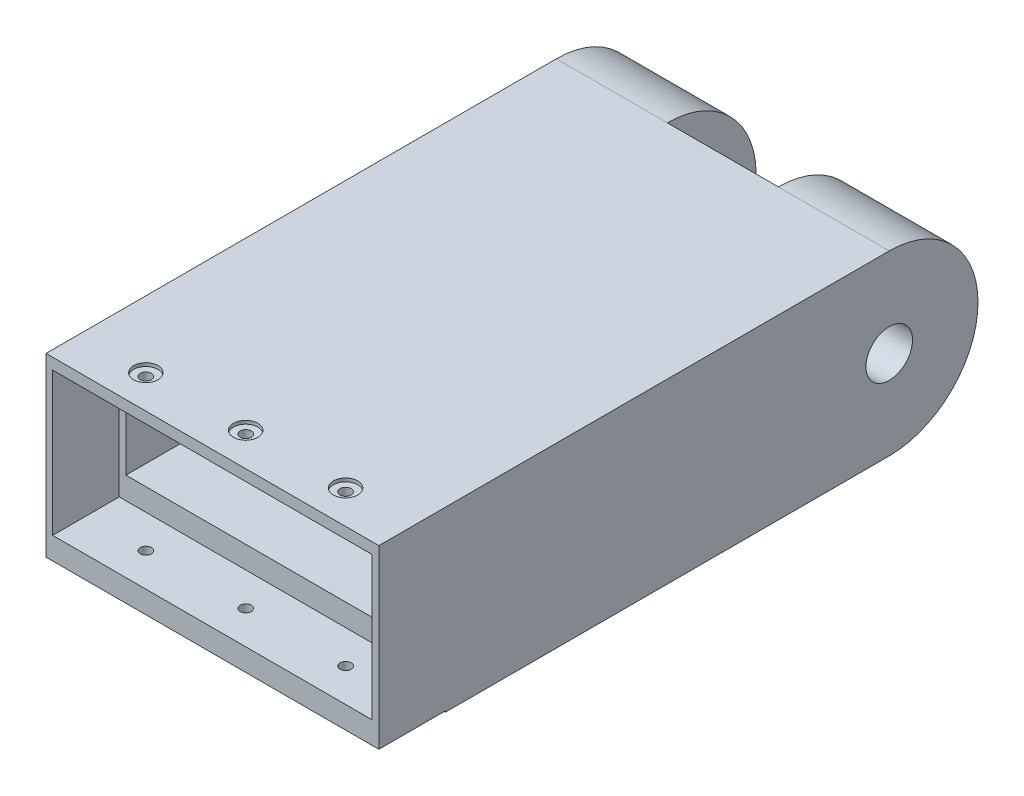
ISO-10303-21;
HEADER;
FILE_DESCRIPTION(('STEP AP214'),'2;1');
FILE_NAME('part.step','',(''),(''),'','','');
FILE_SCHEMA(('AUTOMOTIVE_DESIGN { 1 0 10303 214 1 1 1 1 }'));
ENDSEC;
DATA;
#1=APPLICATION_CONTEXT('core data for automotive mechanical design processes');
#2=APPLICATION_PROTOCOL_DEFINITION('international standard','automotive_design',2000,#1);
#3=PRODUCT_CONTEXT('',#1,'mechanical');
#4=PRODUCT('Part','Part','',(#3));
#5=PRODUCT_RELATED_PRODUCT_CATEGORY('part','',(#4));
#6=PRODUCT_DEFINITION_FORMATION('','',#4);
#7=PRODUCT_DEFINITION_CONTEXT('part definition',#1,'design');
#8=PRODUCT_DEFINITION('design','',#6,#7);
#9=PRODUCT_DEFINITION_SHAPE('','',#8);
#10=(LENGTH_UNIT() NAMED_UNIT(*) SI_UNIT(.MILLI.,.METRE.));
#11=(NAMED_UNIT(*) PLANE_ANGLE_UNIT() SI_UNIT($,.RADIAN.));
#12=(NAMED_UNIT(*) SI_UNIT($,.STERADIAN.) SOLID_ANGLE_UNIT());
#13=UNCERTAINTY_MEASURE_WITH_UNIT(LENGTH_MEASURE(1.E-05),#10,'distance_accuracy_value','');
#14=(GEOMETRIC_REPRESENTATION_CONTEXT(3) GLOBAL_UNCERTAINTY_ASSIGNED_CONTEXT((#13)) GLOBAL_UNIT_ASSIGNED_CONTEXT((#10,
#11,#12)) REPRESENTATION_CONTEXT('',''));
#15=CARTESIAN_POINT('',(0.,0.,0.));
#16=DIRECTION('',(0.,0.,1.));
#17=DIRECTION('',(1.,0.,0.));
#18=AXIS2_PLACEMENT_3D('',#15,#16,#17);
#19=CARTESIAN_POINT('',(-12.3023936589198,147.51739571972,1405.00000000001));
#20=DIRECTION('',(0.,-1.,0.));
#21=DIRECTION('',(0.,0.,-1.));
#22=AXIS2_PLACEMENT_3D('',#19,#20,#21);
#23=CYLINDRICAL_SURFACE('',#22,2.49999999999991);
#24=CARTESIAN_POINT('',(-12.3023936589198,137.51739571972,1405.00000000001));
#25=DIRECTION('',(0.,-1.,0.));
#26=DIRECTION('',(0.,0.,-1.));
#27=AXIS2_PLACEMENT_3D('',#24,#25,#26);
#28=CIRCLE('',#27,2.49999999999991);
#29=CARTESIAN_POINT('',(-12.3023936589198,137.51739571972,1402.50000000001));
#30=VERTEX_POINT('',#29);
#31=EDGE_CURVE('E385',#30,#30,#28,.T.);
#32=ORIENTED_EDGE('',*,*,#31,.T.);
#33=EDGE_LOOP('',(#32));
#34=FACE_BOUND('',#33,.T.);
#35=CARTESIAN_POINT('',(-12.3023936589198,141.01739571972,1405.00000000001));
#36=DIRECTION('',(0.,1.,0.));
#37=DIRECTION('',(0.,0.,1.));
#38=AXIS2_PLACEMENT_3D('',#35,#36,#37);
#39=CIRCLE('',#38,2.49999999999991);
#40=CARTESIAN_POINT('',(-12.3023936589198,141.01739571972,1407.50000000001));
#41=VERTEX_POINT('',#40);
#42=EDGE_CURVE('E45',#41,#41,#39,.F.);
#43=ORIENTED_EDGE('',*,*,#42,.F.);
#44=EDGE_LOOP('',(#43));
#45=FACE_BOUND('',#44,.T.);
#46=ADVANCED_FACE('F41',(#34,#45),#23,.F.);
#47=CARTESIAN_POINT('',(-57.3023936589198,147.51739571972,1405.00000000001));
#48=DIRECTION('',(0.,-1.,0.));
#49=DIRECTION('',(0.,0.,-1.));
#50=AXIS2_PLACEMENT_3D('',#47,#48,#49);
#51=CYLINDRICAL_SURFACE('',#50,2.49999999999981);
#52=CARTESIAN_POINT('',(-57.3023936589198,137.51739571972,1405.00000000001));
#53=DIRECTION('',(0.,-1.,0.));
#54=DIRECTION('',(0.,0.,-1.));
#55=AXIS2_PLACEMENT_3D('',#52,#53,#54);
#56=CIRCLE('',#55,2.49999999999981);
#57=CARTESIAN_POINT('',(-57.3023936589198,137.51739571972,1402.50000000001));
#58=VERTEX_POINT('',#57);
#59=EDGE_CURVE('E389',#58,#58,#56,.T.);
#60=ORIENTED_EDGE('',*,*,#59,.T.);
#61=EDGE_LOOP('',(#60));
#62=FACE_BOUND('',#61,.T.);
#63=CARTESIAN_POINT('',(-57.3023936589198,141.01739571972,1405.00000000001));
#64=DIRECTION('',(0.,1.,0.));
#65=DIRECTION('',(0.,0.,1.));
#66=AXIS2_PLACEMENT_3D('',#63,#64,#65);
#67=CIRCLE('',#66,2.49999999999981);
#68=CARTESIAN_POINT('',(-57.3023936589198,141.01739571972,1407.50000000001));
#69=VERTEX_POINT('',#68);
#70=EDGE_CURVE('E379',#69,#69,#67,.F.);
#71=ORIENTED_EDGE('',*,*,#70,.F.);
#72=EDGE_LOOP('',(#71));
#73=FACE_BOUND('',#72,.T.);
#74=ADVANCED_FACE('F512',(#62,#73),#51,.F.);
#75=CARTESIAN_POINT('',(-102.30239365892,147.51739571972,1405.00000000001));
#76=DIRECTION('',(0.,-1.,0.));
#77=DIRECTION('',(0.,0.,-1.));
#78=AXIS2_PLACEMENT_3D('',#75,#76,#77);
#79=CYLINDRICAL_SURFACE('',#78,2.49999999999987);
#80=CARTESIAN_POINT('',(-102.30239365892,137.51739571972,1405.00000000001));
#81=DIRECTION('',(0.,-1.,0.));
#82=DIRECTION('',(0.,0.,-1.));
#83=AXIS2_PLACEMENT_3D('',#80,#81,#82);
#84=CIRCLE('',#83,2.49999999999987);
#85=CARTESIAN_POINT('',(-102.30239365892,137.51739571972,1402.50000000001));
#86=VERTEX_POINT('',#85);
#87=EDGE_CURVE('E394',#86,#86,#84,.T.);
#88=ORIENTED_EDGE('',*,*,#87,.T.);
#89=EDGE_LOOP('',(#88));
#90=FACE_BOUND('',#89,.T.);
#91=CARTESIAN_POINT('',(-102.30239365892,141.01739571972,1405.00000000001));
#92=DIRECTION('',(0.,1.,0.));
#93=DIRECTION('',(0.,0.,1.));
#94=AXIS2_PLACEMENT_3D('',#91,#92,#93);
#95=CIRCLE('',#94,2.49999999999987);
#96=CARTESIAN_POINT('',(-102.30239365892,141.01739571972,1407.50000000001));
#97=VERTEX_POINT('',#96);
#98=EDGE_CURVE('E377',#97,#97,#95,.F.);
#99=ORIENTED_EDGE('',*,*,#98,.F.);
#100=EDGE_LOOP('',(#99));
#101=FACE_BOUND('',#100,.T.);
#102=ADVANCED_FACE('F518',(#90,#101),#79,.F.);
#103=CARTESIAN_POINT('',(17.6976063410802,62.5173957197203,1390.00000000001));
#104=DIRECTION('',(0.,0.,-1.));
#105=DIRECTION('',(-1.,0.,0.));
#106=AXIS2_PLACEMENT_3D('',#103,#104,#105);
#107=PLANE('',#106);
#108=DIRECTION('',(1.,0.,0.));
#109=VECTOR('',#108,1.);
#110=CARTESIAN_POINT('',(-132.30239365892,63.0246653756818,1390.00000000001));
#111=LINE('',#110,#109);
#112=CARTESIAN_POINT('',(-32.3023936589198,63.0246653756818,1390.00000000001));
#113=VERTEX_POINT('',#112);
#114=CARTESIAN_POINT('',(17.6976063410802,63.0246653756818,1390.00000000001));
#115=VERTEX_POINT('',#114);
#116=EDGE_CURVE('E12',#113,#115,#111,.T.);
#117=ORIENTED_EDGE('',*,*,#116,.F.);
#118=DIRECTION('',(0.,-1.,0.));
#119=VECTOR('',#118,1.);
#120=CARTESIAN_POINT('',(-32.3023936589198,62.5173957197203,1390.00000000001));
#121=LINE('',#120,#119);
#122=CARTESIAN_POINT('',(-32.3023936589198,62.5173957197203,1390.00000000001));
#123=VERTEX_POINT('',#122);
#124=EDGE_CURVE('E362',#113,#123,#121,.T.);
#125=ORIENTED_EDGE('',*,*,#124,.T.);
#126=DIRECTION('',(-1.,0.,0.));
#127=VECTOR('',#126,1.);
#128=CARTESIAN_POINT('',(17.6976063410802,62.5173957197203,1390.00000000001));
#129=LINE('',#128,#127);
#130=CARTESIAN_POINT('',(17.6976063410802,62.5173957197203,1390.00000000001));
#131=VERTEX_POINT('',#130);
#132=EDGE_CURVE('E367',#131,#123,#129,.T.);
#133=ORIENTED_EDGE('',*,*,#132,.F.);
#134=DIRECTION('',(0.,-1.,0.));
#135=VECTOR('',#134,1.);
#136=CARTESIAN_POINT('',(17.6976063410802,142.51739571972,1390.00000000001));
#137=LINE('',#136,#135);
#138=EDGE_CURVE('E356',#115,#131,#137,.T.);
#139=ORIENTED_EDGE('',*,*,#138,.F.);
#140=EDGE_LOOP('',(#117,#125,#133,#139));
#141=FACE_BOUND('',#140,.T.);
#142=ADVANCED_FACE('F479',(#141),#107,.F.);
#143=CARTESIAN_POINT('',(17.6976063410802,102.51739571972,1190.00000000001));
#144=DIRECTION('',(-1.,0.,0.));
#145=DIRECTION('',(0.,0.,1.));
#146=AXIS2_PLACEMENT_3D('',#143,#144,#145);
#147=CYLINDRICAL_SURFACE('',#146,40.);
#148=CARTESIAN_POINT('',(-32.3023936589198,102.51739571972,1190.00000000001));
#149=DIRECTION('',(1.,0.,0.));
#150=DIRECTION('',(0.,0.,1.));
#151=AXIS2_PLACEMENT_3D('',#148,#149,#150);
#152=CIRCLE('',#151,40.);
#153=CARTESIAN_POINT('',(-32.3023936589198,62.5173957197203,1190.00000000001));
#154=VERTEX_POINT('',#153);
#155=CARTESIAN_POINT('',(-32.3023936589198,142.51739571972,1190.00000000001));
#156=VERTEX_POINT('',#155);
#157=EDGE_CURVE('E349',#154,#156,#152,.T.);
#158=ORIENTED_EDGE('',*,*,#157,.T.);
#159=DIRECTION('',(-1.,0.,0.));
#160=VECTOR('',#159,1.);
#161=CARTESIAN_POINT('',(17.6976063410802,142.51739571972,1190.00000000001));
#162=LINE('',#161,#160);
#163=CARTESIAN_POINT('',(17.6976063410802,142.51739571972,1190.00000000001));
#164=VERTEX_POINT('',#163);
#165=EDGE_CURVE('E50',#164,#156,#162,.T.);
#166=ORIENTED_EDGE('',*,*,#165,.F.);
#167=CARTESIAN_POINT('',(17.6976063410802,102.51739571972,1190.00000000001));
#168=DIRECTION('',(1.,0.,0.));
#169=DIRECTION('',(0.,0.,1.));
#170=AXIS2_PLACEMENT_3D('',#167,#168,#169);
#171=CIRCLE('',#170,40.);
#172=CARTESIAN_POINT('',(17.6976063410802,62.5173957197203,1190.00000000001));
#173=VERTEX_POINT('',#172);
#174=EDGE_CURVE('E350',#173,#164,#171,.T.);
#175=ORIENTED_EDGE('',*,*,#174,.F.);
#176=DIRECTION('',(-1.,0.,0.));
#177=VECTOR('',#176,1.);
#178=CARTESIAN_POINT('',(17.6976063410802,62.5173957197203,1190.00000000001));
#179=LINE('',#178,#177);
#180=EDGE_CURVE('E360',#173,#154,#179,.T.);
#181=ORIENTED_EDGE('',*,*,#180,.T.);
#182=EDGE_LOOP('',(#158,#166,#175,#181));
#183=FACE_BOUND('',#182,.T.);
#184=ADVANCED_FACE('F43',(#183),#147,.T.);
#185=CARTESIAN_POINT('',(17.6976063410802,142.51739571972,1190.00000000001));
#186=DIRECTION('',(0.,-1.,0.));
#187=DIRECTION('',(0.,0.,-1.));
#188=AXIS2_PLACEMENT_3D('',#185,#186,#187);
#189=PLANE('',#188);
#190=CARTESIAN_POINT('',(-12.3023936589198,142.51739571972,1405.00000000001));
#191=DIRECTION('',(0.,1.,0.));
#192=DIRECTION('',(0.,0.,1.));
#193=AXIS2_PLACEMENT_3D('',#190,#191,#192);
#194=CIRCLE('',#193,5.49999999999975);
#195=CARTESIAN_POINT('',(-12.3023936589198,142.51739571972,1410.50000000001));
#196=VERTEX_POINT('',#195);
#197=EDGE_CURVE('E983',#196,#196,#194,.T.);
#198=ORIENTED_EDGE('',*,*,#197,.F.);
#199=EDGE_LOOP('',(#198));
#200=FACE_BOUND('',#199,.T.);
#201=CARTESIAN_POINT('',(-57.3023936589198,142.51739571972,1405.00000000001));
#202=DIRECTION('',(0.,1.,0.));
#203=DIRECTION('',(0.,0.,1.));
#204=AXIS2_PLACEMENT_3D('',#201,#202,#203);
#205=CIRCLE('',#204,5.49999999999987);
#206=CARTESIAN_POINT('',(-57.3023936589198,142.51739571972,1410.50000000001));
#207=VERTEX_POINT('',#206);
#208=EDGE_CURVE('E984',#207,#207,#205,.T.);
#209=ORIENTED_EDGE('',*,*,#208,.F.);
#210=EDGE_LOOP('',(#209));
#211=FACE_BOUND('',#210,.T.);
#212=CARTESIAN_POINT('',(-102.30239365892,142.51739571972,1405.00000000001));
#213=DIRECTION('',(0.,1.,0.));
#214=DIRECTION('',(0.,0.,1.));
#215=AXIS2_PLACEMENT_3D('',#212,#213,#214);
#216=CIRCLE('',#215,5.4999999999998);
#217=CARTESIAN_POINT('',(-102.30239365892,142.51739571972,1410.50000000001));
#218=VERTEX_POINT('',#217);
#219=EDGE_CURVE('E993',#218,#218,#216,.T.);
#220=ORIENTED_EDGE('',*,*,#219,.F.);
#221=EDGE_LOOP('',(#220));
#222=FACE_BOUND('',#221,.T.);
#223=ORIENTED_EDGE('',*,*,#165,.T.);
#224=DIRECTION('',(1.,0.,0.));
#225=VECTOR('',#224,1.);
#226=CARTESIAN_POINT('',(-82.3023936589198,142.51739571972,1190.00000000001));
#227=LINE('',#226,#225);
#228=CARTESIAN_POINT('',(-82.3023936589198,142.51739571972,1190.00000000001));
#229=VERTEX_POINT('',#228);
#230=EDGE_CURVE('E346',#229,#156,#227,.T.);
#231=ORIENTED_EDGE('',*,*,#230,.F.);
#232=DIRECTION('',(1.,0.,0.));
#233=VECTOR('',#232,1.);
#234=CARTESIAN_POINT('',(-132.30239365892,142.51739571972,1190.00000000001));
#235=LINE('',#234,#233);
#236=CARTESIAN_POINT('',(-132.30239365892,142.51739571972,1190.00000000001));
#237=VERTEX_POINT('',#236);
#238=EDGE_CURVE('E319',#237,#229,#235,.T.);
#239=ORIENTED_EDGE('',*,*,#238,.F.);
#240=DIRECTION('',(0.,0.,-1.));
#241=VECTOR('',#240,1.);
#242=CARTESIAN_POINT('',(-132.30239365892,142.51739571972,1190.00000000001));
#243=LINE('',#242,#241);
#244=CARTESIAN_POINT('',(-132.30239365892,142.51739571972,1420.00000000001));
#245=VERTEX_POINT('',#244);
#246=EDGE_CURVE('E317',#245,#237,#243,.T.);
#247=ORIENTED_EDGE('',*,*,#246,.F.);
#248=DIRECTION('',(-1.,0.,0.));
#249=VECTOR('',#248,1.);
#250=CARTESIAN_POINT('',(-132.30239365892,142.51739571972,1420.00000000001));
#251=LINE('',#250,#249);
#252=CARTESIAN_POINT('',(17.6976063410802,142.51739571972,1420.00000000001));
#253=VERTEX_POINT('',#252);
#254=EDGE_CURVE('E242',#253,#245,#251,.T.);
#255=ORIENTED_EDGE('',*,*,#254,.F.);
#256=DIRECTION('',(0.,0.,1.));
#257=VECTOR('',#256,1.);
#258=CARTESIAN_POINT('',(17.6976063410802,142.51739571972,1190.00000000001));
#259=LINE('',#258,#257);
#260=EDGE_CURVE('E353',#164,#253,#259,.T.);
#261=ORIENTED_EDGE('',*,*,#260,.F.);
#262=EDGE_LOOP('',(#223,#231,#239,#247,#255,#261));
#263=FACE_BOUND('',#262,.T.);
#264=ADVANCED_FACE('F494',(#200,#211,#222,#263),#189,.F.);
#265=DIRECTION('',(-1.,0.,0.));
#266=VECTOR('',#265,1.);
#267=CARTESIAN_POINT('',(-129.30239365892,137.51739571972,1390.00000000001));
#268=LINE('',#267,#266);
#269=CARTESIAN_POINT('',(14.6976063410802,137.51739571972,1390.00000000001));
#270=VERTEX_POINT('',#269);
#271=CARTESIAN_POINT('',(-129.30239365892,137.51739571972,1390.00000000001));
#272=VERTEX_POINT('',#271);
#273=EDGE_CURVE('E202',#270,#272,#268,.T.);
#274=ORIENTED_EDGE('',*,*,#273,.T.);
#275=DIRECTION('',(0.,-1.,0.));
#276=VECTOR('',#275,1.);
#277=CARTESIAN_POINT('',(-129.30239365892,137.51739571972,1390.00000000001));
#278=LINE('',#277,#276);
#279=CARTESIAN_POINT('',(-129.30239365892,73.0246653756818,1390.00000000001));
#280=VERTEX_POINT('',#279);
#281=EDGE_CURVE('E222',#272,#280,#278,.T.);
#282=ORIENTED_EDGE('',*,*,#281,.T.);
#283=DIRECTION('',(1.,0.,0.));
#284=VECTOR('',#283,1.);
#285=CARTESIAN_POINT('',(-129.30239365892,73.0246653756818,1390.00000000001));
#286=LINE('',#285,#284);
#287=CARTESIAN_POINT('',(14.6976063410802,73.0246653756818,1390.00000000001));
#288=VERTEX_POINT('',#287);
#289=EDGE_CURVE('E208',#280,#288,#286,.T.);
#290=ORIENTED_EDGE('',*,*,#289,.T.);
#291=DIRECTION('',(0.,1.,0.));
#292=VECTOR('',#291,1.);
#293=CARTESIAN_POINT('',(14.6976063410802,137.51739571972,1390.00000000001));
#294=LINE('',#293,#292);
#295=EDGE_CURVE('E226',#288,#270,#294,.T.);
#296=ORIENTED_EDGE('',*,*,#295,.T.);
#297=EDGE_LOOP('',(#274,#282,#290,#296));
#298=FACE_BOUND('',#297,.T.);
#299=DIRECTION('',(0.,-1.,0.));
#300=VECTOR('',#299,1.);
#301=CARTESIAN_POINT('',(-126.30239365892,83.0246653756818,1390.00000000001));
#302=LINE('',#301,#300);
#303=CARTESIAN_POINT('',(-126.30239365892,132.51739571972,1390.00000000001));
#304=VERTEX_POINT('',#303);
#305=CARTESIAN_POINT('',(-126.30239365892,83.0246653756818,1390.00000000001));
#306=VERTEX_POINT('',#305);
#307=EDGE_CURVE('E297',#304,#306,#302,.T.);
#308=ORIENTED_EDGE('',*,*,#307,.F.);
#309=DIRECTION('',(1.,0.,0.));
#310=VECTOR('',#309,1.);
#311=CARTESIAN_POINT('',(-323.80834750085,132.51739571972,1390.00000000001));
#312=LINE('',#311,#310);
#313=CARTESIAN_POINT('',(11.6976063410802,132.51739571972,1390.00000000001));
#314=VERTEX_POINT('',#313);
#315=EDGE_CURVE('E281',#304,#314,#312,.T.);
#316=ORIENTED_EDGE('',*,*,#315,.T.);
#317=DIRECTION('',(0.,-1.,0.));
#318=VECTOR('',#317,1.);
#319=CARTESIAN_POINT('',(11.6976063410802,83.0246653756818,1390.00000000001));
#320=LINE('',#319,#318);
#321=CARTESIAN_POINT('',(11.6976063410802,83.0246653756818,1390.00000000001));
#322=VERTEX_POINT('',#321);
#323=EDGE_CURVE('E271',#314,#322,#320,.T.);
#324=ORIENTED_EDGE('',*,*,#323,.T.);
#325=DIRECTION('',(1.,0.,0.));
#326=VECTOR('',#325,1.);
#327=CARTESIAN_POINT('',(-323.80834750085,83.0246653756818,1390.00000000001));
#328=LINE('',#327,#326);
#329=EDGE_CURVE('E296',#306,#322,#328,.T.);
#330=ORIENTED_EDGE('',*,*,#329,.F.);
#331=EDGE_LOOP('',(#308,#316,#324,#330));
#332=FACE_BOUND('',#331,.T.);
#333=ADVANCED_FACE('F612',(#298,#332),#107,.F.);
#334=CARTESIAN_POINT('',(17.6976063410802,62.5173957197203,1190.00000000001));
#335=DIRECTION('',(0.,1.,0.));
#336=DIRECTION('',(-1.,0.,0.));
#337=AXIS2_PLACEMENT_3D('',#334,#335,#336);
#338=PLANE('',#337);
#339=DIRECTION('',(0.,0.,-1.));
#340=VECTOR('',#339,1.);
#341=CARTESIAN_POINT('',(-32.3023936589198,62.5173957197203,1190.00000000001));
#342=LINE('',#341,#340);
#343=EDGE_CURVE('E354',#123,#154,#342,.T.);
#344=ORIENTED_EDGE('',*,*,#343,.T.);
#345=ORIENTED_EDGE('',*,*,#180,.F.);
#346=DIRECTION('',(0.,0.,-1.));
#347=VECTOR('',#346,1.);
#348=CARTESIAN_POINT('',(17.6976063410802,62.5173957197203,1190.00000000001));
#349=LINE('',#348,#347);
#350=EDGE_CURVE('E358',#131,#173,#349,.T.);
#351=ORIENTED_EDGE('',*,*,#350,.F.);
#352=ORIENTED_EDGE('',*,*,#132,.T.);
#353=EDGE_LOOP('',(#344,#345,#351,#352));
#354=FACE_BOUND('',#353,.T.);
#355=ADVANCED_FACE('F482',(#354),#338,.F.);
#356=CARTESIAN_POINT('',(17.6976063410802,102.51739571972,1190.00000000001));
#357=DIRECTION('',(-1.,0.,0.));
#358=DIRECTION('',(0.,0.,1.));
#359=AXIS2_PLACEMENT_3D('',#356,#357,#358);
#360=PLANE('',#359);
#361=CARTESIAN_POINT('',(17.6976063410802,102.51739571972,1190.00000000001));
#362=DIRECTION('',(-1.,0.,0.));
#363=DIRECTION('',(0.,0.,1.));
#364=AXIS2_PLACEMENT_3D('',#361,#362,#363);
#365=CIRCLE('',#364,10.4999999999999);
#366=CARTESIAN_POINT('',(17.6976063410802,102.51739571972,1200.50000000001));
#367=VERTEX_POINT('',#366);
#368=EDGE_CURVE('E376',#367,#367,#365,.T.);
#369=ORIENTED_EDGE('',*,*,#368,.T.);
#370=EDGE_LOOP('',(#369));
#371=FACE_BOUND('',#370,.T.);
#372=ORIENTED_EDGE('',*,*,#174,.T.);
#373=ORIENTED_EDGE('',*,*,#260,.T.);
#374=DIRECTION('',(0.,1.,0.));
#375=VECTOR('',#374,1.);
#376=CARTESIAN_POINT('',(17.6976063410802,142.51739571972,1420.00000000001));
#377=LINE('',#376,#375);
#378=CARTESIAN_POINT('',(17.6976063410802,63.0246653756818,1420.00000000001));
#379=VERTEX_POINT('',#378);
#380=EDGE_CURVE('E239',#379,#253,#377,.T.);
#381=ORIENTED_EDGE('',*,*,#380,.F.);
#382=DIRECTION('',(0.,0.,-1.));
#383=VECTOR('',#382,1.);
#384=CARTESIAN_POINT('',(17.6976063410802,63.0246653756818,1420.00000000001));
#385=LINE('',#384,#383);
#386=EDGE_CURVE('E244',#379,#115,#385,.T.);
#387=ORIENTED_EDGE('',*,*,#386,.T.);
#388=ORIENTED_EDGE('',*,*,#138,.T.);
#389=ORIENTED_EDGE('',*,*,#350,.T.);
#390=EDGE_LOOP('',(#372,#373,#381,#387,#388,#389));
#391=FACE_BOUND('',#390,.T.);
#392=ADVANCED_FACE('F486',(#371,#391),#360,.F.);
#393=CARTESIAN_POINT('',(-32.3023936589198,102.51739571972,1190.00000000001));
#394=DIRECTION('',(-1.,0.,0.));
#395=DIRECTION('',(0.,0.,1.));
#396=AXIS2_PLACEMENT_3D('',#393,#394,#395);
#397=PLANE('',#396);
#398=CARTESIAN_POINT('',(-32.3023936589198,102.51739571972,1190.00000000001));
#399=DIRECTION('',(-1.,0.,0.));
#400=DIRECTION('',(0.,0.,1.));
#401=AXIS2_PLACEMENT_3D('',#398,#399,#400);
#402=CIRCLE('',#401,10.4999999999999);
#403=CARTESIAN_POINT('',(-32.3023936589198,102.51739571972,1200.50000000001));
#404=VERTEX_POINT('',#403);
#405=EDGE_CURVE('E402',#404,#404,#402,.T.);
#406=ORIENTED_EDGE('',*,*,#405,.F.);
#407=EDGE_LOOP('',(#406));
#408=FACE_BOUND('',#407,.T.);
#409=DIRECTION('',(0.,0.,1.));
#410=VECTOR('',#409,1.);
#411=CARTESIAN_POINT('',(-32.3023936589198,63.0246653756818,1183.64986220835));
#412=LINE('',#411,#410);
#413=CARTESIAN_POINT('',(-32.3023936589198,63.0246653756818,1223.64986220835));
#414=VERTEX_POINT('',#413);
#415=EDGE_CURVE('E338',#414,#113,#412,.T.);
#416=ORIENTED_EDGE('',*,*,#415,.F.);
#417=DIRECTION('',(0.,-1.,0.));
#418=VECTOR('',#417,1.);
#419=CARTESIAN_POINT('',(-32.3023936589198,142.51839571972,1223.64986220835));
#420=LINE('',#419,#418);
#421=CARTESIAN_POINT('',(-32.3023936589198,83.0246653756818,1223.64986220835));
#422=VERTEX_POINT('',#421);
#423=EDGE_CURVE('E257',#422,#414,#420,.T.);
#424=ORIENTED_EDGE('',*,*,#423,.F.);
#425=DIRECTION('',(0.,0.,-1.));
#426=VECTOR('',#425,1.);
#427=CARTESIAN_POINT('',(-32.3023936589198,83.0246653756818,1183.64986220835));
#428=LINE('',#427,#426);
#429=CARTESIAN_POINT('',(-32.3023936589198,83.0246653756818,1205.6535447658));
#430=VERTEX_POINT('',#429);
#431=EDGE_CURVE('E260',#422,#430,#428,.T.);
#432=ORIENTED_EDGE('',*,*,#431,.T.);
#433=CARTESIAN_POINT('',(-32.3023936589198,102.51739571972,1190.00000000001));
#434=DIRECTION('',(-1.,0.,0.));
#435=DIRECTION('',(0.,0.,1.));
#436=AXIS2_PLACEMENT_3D('',#433,#434,#435);
#437=CIRCLE('',#436,25.);
#438=CARTESIAN_POINT('',(-32.3023936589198,122.51739571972,1205.00000000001));
#439=VERTEX_POINT('',#438);
#440=EDGE_CURVE('E308',#439,#430,#437,.F.);
#441=ORIENTED_EDGE('',*,*,#440,.F.);
#442=CARTESIAN_POINT('',(-32.3023936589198,102.51739571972,1190.00000000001));
#443=DIRECTION('',(1.,0.,0.));
#444=DIRECTION('',(0.,0.,-1.));
#445=AXIS2_PLACEMENT_3D('',#442,#443,#444);
#446=CIRCLE('',#445,25.);
#447=CARTESIAN_POINT('',(-32.3023936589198,127.51739571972,1190.00000000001));
#448=VERTEX_POINT('',#447);
#449=EDGE_CURVE('E327',#448,#439,#446,.T.);
#450=ORIENTED_EDGE('',*,*,#449,.F.);
#451=DIRECTION('',(0.,-1.,0.));
#452=VECTOR('',#451,1.);
#453=CARTESIAN_POINT('',(-32.3023936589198,142.51739571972,1190.00000000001));
#454=LINE('',#453,#452);
#455=EDGE_CURVE('E341',#156,#448,#454,.T.);
#456=ORIENTED_EDGE('',*,*,#455,.F.);
#457=ORIENTED_EDGE('',*,*,#157,.F.);
#458=ORIENTED_EDGE('',*,*,#343,.F.);
#459=ORIENTED_EDGE('',*,*,#124,.F.);
#460=EDGE_LOOP('',(#416,#424,#432,#441,#450,#456,#457,#458,#459));
#461=FACE_BOUND('',#460,.T.);
#462=ADVANCED_FACE('F473',(#408,#461),#397,.T.);
#463=CARTESIAN_POINT('',(-82.3023936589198,102.51739571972,1190.00000000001));
#464=DIRECTION('',(1.,0.,0.));
#465=DIRECTION('',(0.,0.,-1.));
#466=AXIS2_PLACEMENT_3D('',#463,#464,#465);
#467=CYLINDRICAL_SURFACE('',#466,25.);
#468=ORIENTED_EDGE('',*,*,#449,.T.);
#469=DIRECTION('',(1.,0.,0.));
#470=VECTOR('',#469,1.);
#471=CARTESIAN_POINT('',(-323.80834750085,122.51739571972,1205.00000000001));
#472=LINE('',#471,#470);
#473=CARTESIAN_POINT('',(-82.3023936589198,122.51739571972,1205.00000000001));
#474=VERTEX_POINT('',#473);
#475=EDGE_CURVE('E301',#474,#439,#472,.T.);
#476=ORIENTED_EDGE('',*,*,#475,.F.);
#477=CARTESIAN_POINT('',(-82.3023936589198,102.51739571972,1190.00000000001));
#478=DIRECTION('',(1.,0.,0.));
#479=DIRECTION('',(0.,0.,-1.));
#480=AXIS2_PLACEMENT_3D('',#477,#478,#479);
#481=CIRCLE('',#480,25.);
#482=CARTESIAN_POINT('',(-82.3023936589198,127.51739571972,1190.00000000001));
#483=VERTEX_POINT('',#482);
#484=EDGE_CURVE('E328',#483,#474,#481,.T.);
#485=ORIENTED_EDGE('',*,*,#484,.F.);
#486=DIRECTION('',(1.,0.,0.));
#487=VECTOR('',#486,1.);
#488=CARTESIAN_POINT('',(-82.3023936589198,127.51739571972,1190.00000000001));
#489=LINE('',#488,#487);
#490=EDGE_CURVE('E335',#483,#448,#489,.T.);
#491=ORIENTED_EDGE('',*,*,#490,.T.);
#492=EDGE_LOOP('',(#468,#476,#485,#491));
#493=FACE_BOUND('',#492,.T.);
#494=ADVANCED_FACE('F453',(#493),#467,.F.);
#495=CARTESIAN_POINT('',(-82.3023936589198,63.0246653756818,1183.64986220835));
#496=DIRECTION('',(0.,1.,0.));
#497=DIRECTION('',(-1.,0.,0.));
#498=AXIS2_PLACEMENT_3D('',#495,#496,#497);
#499=PLANE('',#498);
#500=CARTESIAN_POINT('',(-102.30239365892,63.0246653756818,1405.00000000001));
#501=DIRECTION('',(0.,-1.,0.));
#502=DIRECTION('',(1.,0.,0.));
#503=AXIS2_PLACEMENT_3D('',#500,#501,#502);
#504=CIRCLE('',#503,5.49999999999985);
#505=CARTESIAN_POINT('',(-96.80239365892,63.0246653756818,1405.00000000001));
#506=VERTEX_POINT('',#505);
#507=EDGE_CURVE('E426',#506,#506,#504,.T.);
#508=ORIENTED_EDGE('',*,*,#507,.F.);
#509=EDGE_LOOP('',(#508));
#510=FACE_BOUND('',#509,.T.);
#511=CARTESIAN_POINT('',(-57.3023936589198,63.0246653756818,1405.00000000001));
#512=DIRECTION('',(0.,-1.,0.));
#513=DIRECTION('',(1.,0.,0.));
#514=AXIS2_PLACEMENT_3D('',#511,#512,#513);
#515=CIRCLE('',#514,5.49999999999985);
#516=CARTESIAN_POINT('',(-51.8023936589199,63.0246653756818,1405.00000000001));
#517=VERTEX_POINT('',#516);
#518=EDGE_CURVE('E429',#517,#517,#515,.T.);
#519=ORIENTED_EDGE('',*,*,#518,.F.);
#520=EDGE_LOOP('',(#519));
#521=FACE_BOUND('',#520,.T.);
#522=CARTESIAN_POINT('',(-12.3023936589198,63.0246653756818,1405.00000000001));
#523=DIRECTION('',(0.,-1.,0.));
#524=DIRECTION('',(1.,0.,0.));
#525=AXIS2_PLACEMENT_3D('',#522,#523,#524);
#526=CIRCLE('',#525,5.49999999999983);
#527=CARTESIAN_POINT('',(-6.80239365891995,63.0246653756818,1405.00000000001));
#528=VERTEX_POINT('',#527);
#529=EDGE_CURVE('E435',#528,#528,#526,.T.);
#530=ORIENTED_EDGE('',*,*,#529,.F.);
#531=EDGE_LOOP('',(#530));
#532=FACE_BOUND('',#531,.T.);
#533=DIRECTION('',(1.,0.,0.));
#534=VECTOR('',#533,1.);
#535=CARTESIAN_POINT('',(-132.30239365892,63.0246653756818,1183.64986220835));
#536=LINE('',#535,#534);
#537=CARTESIAN_POINT('',(-132.30239365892,63.0246653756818,1183.64986220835));
#538=VERTEX_POINT('',#537);
#539=CARTESIAN_POINT('',(-82.3023936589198,63.0246653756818,1183.64986220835));
#540=VERTEX_POINT('',#539);
#541=EDGE_CURVE('E324',#538,#540,#536,.T.);
#542=ORIENTED_EDGE('',*,*,#541,.T.);
#543=DIRECTION('',(0.,0.,-1.));
#544=VECTOR('',#543,1.);
#545=CARTESIAN_POINT('',(-82.3023936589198,63.0246653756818,1183.64986220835));
#546=LINE('',#545,#544);
#547=CARTESIAN_POINT('',(-82.3023936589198,63.0246653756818,1223.64986220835));
#548=VERTEX_POINT('',#547);
#549=EDGE_CURVE('E252',#548,#540,#546,.T.);
#550=ORIENTED_EDGE('',*,*,#549,.F.);
#551=DIRECTION('',(-1.,0.,0.));
#552=VECTOR('',#551,1.);
#553=CARTESIAN_POINT('',(-82.3023936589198,63.0246653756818,1223.64986220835));
#554=LINE('',#553,#552);
#555=EDGE_CURVE('E254',#414,#548,#554,.T.);
#556=ORIENTED_EDGE('',*,*,#555,.F.);
#557=ORIENTED_EDGE('',*,*,#415,.T.);
#558=ORIENTED_EDGE('',*,*,#116,.T.);
#559=ORIENTED_EDGE('',*,*,#386,.F.);
#560=DIRECTION('',(1.,0.,0.));
#561=VECTOR('',#560,1.);
#562=CARTESIAN_POINT('',(-132.30239365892,63.0246653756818,1420.00000000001));
#563=LINE('',#562,#561);
#564=CARTESIAN_POINT('',(-132.30239365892,63.0246653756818,1420.00000000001));
#565=VERTEX_POINT('',#564);
#566=EDGE_CURVE('E237',#565,#379,#563,.T.);
#567=ORIENTED_EDGE('',*,*,#566,.F.);
#568=DIRECTION('',(0.,0.,1.));
#569=VECTOR('',#568,1.);
#570=CARTESIAN_POINT('',(-132.30239365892,63.0246653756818,1390.00000000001));
#571=LINE('',#570,#569);
#572=EDGE_CURVE('E315',#538,#565,#571,.T.);
#573=ORIENTED_EDGE('',*,*,#572,.F.);
#574=EDGE_LOOP('',(#542,#550,#556,#557,#558,#559,#567,#573));
#575=FACE_BOUND('',#574,.T.);
#576=ADVANCED_FACE('F449',(#510,#521,#532,#575),#499,.F.);
#577=CARTESIAN_POINT('',(-82.3023936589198,142.51739571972,1190.00000000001));
#578=DIRECTION('',(0.,0.,1.));
#579=DIRECTION('',(1.,0.,0.));
#580=AXIS2_PLACEMENT_3D('',#577,#578,#579);
#581=PLANE('',#580);
#582=ORIENTED_EDGE('',*,*,#455,.T.);
#583=ORIENTED_EDGE('',*,*,#490,.F.);
#584=DIRECTION('',(0.,-1.,0.));
#585=VECTOR('',#584,1.);
#586=CARTESIAN_POINT('',(-82.3023936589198,142.51739571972,1190.00000000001));
#587=LINE('',#586,#585);
#588=EDGE_CURVE('E331',#229,#483,#587,.T.);
#589=ORIENTED_EDGE('',*,*,#588,.F.);
#590=ORIENTED_EDGE('',*,*,#230,.T.);
#591=EDGE_LOOP('',(#582,#583,#589,#590));
#592=FACE_BOUND('',#591,.T.);
#593=ADVANCED_FACE('F452',(#592),#581,.F.);
#594=CARTESIAN_POINT('',(-132.30239365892,102.51739571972,1190.00000000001));
#595=DIRECTION('',(1.,0.,0.));
#596=DIRECTION('',(0.,0.,-1.));
#597=AXIS2_PLACEMENT_3D('',#594,#595,#596);
#598=CYLINDRICAL_SURFACE('',#597,40.);
#599=CARTESIAN_POINT('',(-82.3023936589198,102.51739571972,1190.00000000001));
#600=DIRECTION('',(-1.,0.,0.));
#601=DIRECTION('',(0.,0.,1.));
#602=AXIS2_PLACEMENT_3D('',#599,#600,#601);
#603=CIRCLE('',#602,40.);
#604=EDGE_CURVE('E311',#229,#540,#603,.T.);
#605=ORIENTED_EDGE('',*,*,#604,.T.);
#606=ORIENTED_EDGE('',*,*,#541,.F.);
#607=CARTESIAN_POINT('',(-132.30239365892,102.51739571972,1190.00000000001));
#608=DIRECTION('',(-1.,0.,0.));
#609=DIRECTION('',(0.,0.,1.));
#610=AXIS2_PLACEMENT_3D('',#607,#608,#609);
#611=CIRCLE('',#610,40.);
#612=EDGE_CURVE('E312',#237,#538,#611,.T.);
#613=ORIENTED_EDGE('',*,*,#612,.F.);
#614=ORIENTED_EDGE('',*,*,#238,.T.);
#615=EDGE_LOOP('',(#605,#606,#613,#614));
#616=FACE_BOUND('',#615,.T.);
#617=ADVANCED_FACE('F463',(#616),#598,.T.);
#618=CARTESIAN_POINT('',(-132.30239365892,102.51739571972,1190.00000000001));
#619=DIRECTION('',(-1.,0.,0.));
#620=DIRECTION('',(0.,0.,1.));
#621=AXIS2_PLACEMENT_3D('',#618,#619,#620);
#622=PLANE('',#621);
#623=CARTESIAN_POINT('',(-132.30239365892,102.51739571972,1190.00000000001));
#624=DIRECTION('',(-1.,0.,0.));
#625=DIRECTION('',(0.,0.,1.));
#626=AXIS2_PLACEMENT_3D('',#623,#624,#625);
#627=CIRCLE('',#626,10.4999999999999);
#628=CARTESIAN_POINT('',(-132.30239365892,102.51739571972,1200.50000000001));
#629=VERTEX_POINT('',#628);
#630=EDGE_CURVE('E375',#629,#629,#627,.T.);
#631=ORIENTED_EDGE('',*,*,#630,.F.);
#632=EDGE_LOOP('',(#631));
#633=FACE_BOUND('',#632,.T.);
#634=ORIENTED_EDGE('',*,*,#612,.T.);
#635=ORIENTED_EDGE('',*,*,#572,.T.);
#636=DIRECTION('',(0.,-1.,0.));
#637=VECTOR('',#636,1.);
#638=CARTESIAN_POINT('',(-132.30239365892,142.51739571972,1420.00000000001));
#639=LINE('',#638,#637);
#640=EDGE_CURVE('E209',#245,#565,#639,.T.);
#641=ORIENTED_EDGE('',*,*,#640,.F.);
#642=ORIENTED_EDGE('',*,*,#246,.T.);
#643=EDGE_LOOP('',(#634,#635,#641,#642));
#644=FACE_BOUND('',#643,.T.);
#645=ADVANCED_FACE('F496',(#633,#644),#622,.T.);
#646=CARTESIAN_POINT('',(-82.3023936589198,102.51739571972,1190.00000000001));
#647=DIRECTION('',(-1.,0.,0.));
#648=DIRECTION('',(0.,0.,1.));
#649=AXIS2_PLACEMENT_3D('',#646,#647,#648);
#650=PLANE('',#649);
#651=CARTESIAN_POINT('',(-82.3023936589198,102.51739571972,1190.00000000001));
#652=DIRECTION('',(-1.,0.,0.));
#653=DIRECTION('',(0.,0.,1.));
#654=AXIS2_PLACEMENT_3D('',#651,#652,#653);
#655=CIRCLE('',#654,10.4999999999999);
#656=CARTESIAN_POINT('',(-82.3023936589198,102.51739571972,1200.50000000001));
#657=VERTEX_POINT('',#656);
#658=EDGE_CURVE('E372',#657,#657,#655,.T.);
#659=ORIENTED_EDGE('',*,*,#658,.T.);
#660=EDGE_LOOP('',(#659));
#661=FACE_BOUND('',#660,.T.);
#662=ORIENTED_EDGE('',*,*,#549,.T.);
#663=ORIENTED_EDGE('',*,*,#604,.F.);
#664=ORIENTED_EDGE('',*,*,#588,.T.);
#665=ORIENTED_EDGE('',*,*,#484,.T.);
#666=CARTESIAN_POINT('',(-82.3023936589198,83.0246653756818,1205.6535447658));
#667=VERTEX_POINT('',#666);
#668=EDGE_CURVE('E332',#474,#667,#481,.T.);
#669=ORIENTED_EDGE('',*,*,#668,.T.);
#670=DIRECTION('',(0.,0.,1.));
#671=VECTOR('',#670,1.);
#672=CARTESIAN_POINT('',(-82.3023936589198,83.0246653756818,1183.64986220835));
#673=LINE('',#672,#671);
#674=CARTESIAN_POINT('',(-82.3023936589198,83.0246653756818,1223.64986220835));
#675=VERTEX_POINT('',#674);
#676=EDGE_CURVE('E249',#667,#675,#673,.T.);
#677=ORIENTED_EDGE('',*,*,#676,.T.);
#678=DIRECTION('',(0.,-1.,0.));
#679=VECTOR('',#678,1.);
#680=CARTESIAN_POINT('',(-82.3023936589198,142.51839571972,1223.64986220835));
#681=LINE('',#680,#679);
#682=EDGE_CURVE('E258',#675,#548,#681,.T.);
#683=ORIENTED_EDGE('',*,*,#682,.T.);
#684=EDGE_LOOP('',(#662,#663,#664,#665,#669,#677,#683));
#685=FACE_BOUND('',#684,.T.);
#686=ADVANCED_FACE('F466',(#661,#685),#650,.F.);
#687=CARTESIAN_POINT('',(-323.80834750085,102.51739571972,1190.00000000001));
#688=DIRECTION('',(1.,0.,0.));
#689=DIRECTION('',(0.,0.,-1.));
#690=AXIS2_PLACEMENT_3D('',#687,#688,#689);
#691=CYLINDRICAL_SURFACE('',#690,25.);
#692=CARTESIAN_POINT('',(-126.30239365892,122.51739571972,1205.00000000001));
#693=VERTEX_POINT('',#692);
#694=EDGE_CURVE('E286',#693,#474,#472,.T.);
#695=ORIENTED_EDGE('',*,*,#694,.F.);
#696=CARTESIAN_POINT('',(-126.30239365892,102.51739571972,1190.00000000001));
#697=DIRECTION('',(-1.,0.,0.));
#698=DIRECTION('',(0.,0.,1.));
#699=AXIS2_PLACEMENT_3D('',#696,#697,#698);
#700=CIRCLE('',#699,25.);
#701=CARTESIAN_POINT('',(-126.30239365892,83.0246653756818,1205.6535447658));
#702=VERTEX_POINT('',#701);
#703=EDGE_CURVE('E287',#702,#693,#700,.T.);
#704=ORIENTED_EDGE('',*,*,#703,.F.);
#705=DIRECTION('',(1.,0.,0.));
#706=VECTOR('',#705,1.);
#707=CARTESIAN_POINT('',(-323.80834750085,83.0246653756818,1205.6535447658));
#708=LINE('',#707,#706);
#709=EDGE_CURVE('E291',#702,#667,#708,.T.);
#710=ORIENTED_EDGE('',*,*,#709,.T.);
#711=ORIENTED_EDGE('',*,*,#668,.F.);
#712=EDGE_LOOP('',(#695,#704,#710,#711));
#713=FACE_BOUND('',#712,.T.);
#714=ADVANCED_FACE('F504',(#713),#691,.T.);
#715=CARTESIAN_POINT('',(-126.30239365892,102.51739571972,1190.00000000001));
#716=DIRECTION('',(-1.,0.,0.));
#717=DIRECTION('',(0.,0.,1.));
#718=AXIS2_PLACEMENT_3D('',#715,#716,#717);
#719=PLANE('',#718);
#720=DIRECTION('',(0.,1.,0.));
#721=VECTOR('',#720,1.);
#722=CARTESIAN_POINT('',(-126.30239365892,122.51739571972,1205.00000000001));
#723=LINE('',#722,#721);
#724=CARTESIAN_POINT('',(-126.30239365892,132.51739571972,1205.00000000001));
#725=VERTEX_POINT('',#724);
#726=EDGE_CURVE('E282',#693,#725,#723,.T.);
#727=ORIENTED_EDGE('',*,*,#726,.T.);
#728=DIRECTION('',(0.,0.,1.));
#729=VECTOR('',#728,1.);
#730=CARTESIAN_POINT('',(-126.30239365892,132.51739571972,1205.00000000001));
#731=LINE('',#730,#729);
#732=EDGE_CURVE('E267',#725,#304,#731,.T.);
#733=ORIENTED_EDGE('',*,*,#732,.T.);
#734=ORIENTED_EDGE('',*,*,#307,.T.);
#735=DIRECTION('',(0.,0.,-1.));
#736=VECTOR('',#735,1.);
#737=CARTESIAN_POINT('',(-126.30239365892,83.0246653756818,1205.6535447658));
#738=LINE('',#737,#736);
#739=EDGE_CURVE('E292',#306,#702,#738,.T.);
#740=ORIENTED_EDGE('',*,*,#739,.T.);
#741=ORIENTED_EDGE('',*,*,#703,.T.);
#742=EDGE_LOOP('',(#727,#733,#734,#740,#741));
#743=FACE_BOUND('',#742,.T.);
#744=ADVANCED_FACE('F581',(#743),#719,.F.);
#745=CARTESIAN_POINT('',(11.6976063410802,102.51739571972,1190.00000000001));
#746=DIRECTION('',(1.,0.,0.));
#747=DIRECTION('',(0.,0.,-1.));
#748=AXIS2_PLACEMENT_3D('',#745,#746,#747);
#749=PLANE('',#748);
#750=DIRECTION('',(0.,1.,0.));
#751=VECTOR('',#750,1.);
#752=CARTESIAN_POINT('',(11.6976063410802,122.51739571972,1205.00000000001));
#753=LINE('',#752,#751);
#754=CARTESIAN_POINT('',(11.6976063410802,122.51739571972,1205.00000000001));
#755=VERTEX_POINT('',#754);
#756=CARTESIAN_POINT('',(11.6976063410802,132.51739571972,1205.00000000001));
#757=VERTEX_POINT('',#756);
#758=EDGE_CURVE('E263',#755,#757,#753,.T.);
#759=ORIENTED_EDGE('',*,*,#758,.F.);
#760=CARTESIAN_POINT('',(11.6976063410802,102.51739571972,1190.00000000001));
#761=DIRECTION('',(-1.,0.,0.));
#762=DIRECTION('',(0.,0.,-1.));
#763=AXIS2_PLACEMENT_3D('',#760,#761,#762);
#764=CIRCLE('',#763,25.);
#765=CARTESIAN_POINT('',(11.6976063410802,83.0246653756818,1205.6535447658));
#766=VERTEX_POINT('',#765);
#767=EDGE_CURVE('E264',#766,#755,#764,.T.);
#768=ORIENTED_EDGE('',*,*,#767,.F.);
#769=DIRECTION('',(0.,0.,-1.));
#770=VECTOR('',#769,1.);
#771=CARTESIAN_POINT('',(11.6976063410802,83.0246653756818,1205.6535447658));
#772=LINE('',#771,#770);
#773=EDGE_CURVE('E268',#322,#766,#772,.T.);
#774=ORIENTED_EDGE('',*,*,#773,.F.);
#775=ORIENTED_EDGE('',*,*,#323,.F.);
#776=DIRECTION('',(0.,0.,1.));
#777=VECTOR('',#776,1.);
#778=CARTESIAN_POINT('',(11.6976063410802,132.51739571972,1205.00000000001));
#779=LINE('',#778,#777);
#780=EDGE_CURVE('E274',#757,#314,#779,.T.);
#781=ORIENTED_EDGE('',*,*,#780,.F.);
#782=EDGE_LOOP('',(#759,#768,#774,#775,#781));
#783=FACE_BOUND('',#782,.T.);
#784=ADVANCED_FACE('F577',(#783),#749,.F.);
#785=CARTESIAN_POINT('',(-323.80834750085,132.51739571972,1205.00000000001));
#786=DIRECTION('',(0.,1.,0.));
#787=DIRECTION('',(-1.,0.,0.));
#788=AXIS2_PLACEMENT_3D('',#785,#786,#787);
#789=PLANE('',#788);
#790=DIRECTION('',(1.,0.,0.));
#791=VECTOR('',#790,1.);
#792=CARTESIAN_POINT('',(-323.80834750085,132.51739571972,1205.00000000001));
#793=LINE('',#792,#791);
#794=EDGE_CURVE('E285',#725,#757,#793,.T.);
#795=ORIENTED_EDGE('',*,*,#794,.T.);
#796=ORIENTED_EDGE('',*,*,#780,.T.);
#797=ORIENTED_EDGE('',*,*,#315,.F.);
#798=ORIENTED_EDGE('',*,*,#732,.F.);
#799=EDGE_LOOP('',(#795,#796,#797,#798));
#800=FACE_BOUND('',#799,.T.);
#801=ADVANCED_FACE('F580',(#800),#789,.F.);
#802=CARTESIAN_POINT('',(-323.80834750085,83.0246653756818,1205.6535447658));
#803=DIRECTION('',(0.,-1.,0.));
#804=DIRECTION('',(0.,0.,-1.));
#805=AXIS2_PLACEMENT_3D('',#802,#803,#804);
#806=PLANE('',#805);
#807=DIRECTION('',(1.,0.,0.));
#808=VECTOR('',#807,1.);
#809=CARTESIAN_POINT('',(-82.3023936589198,83.0246653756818,1223.64986220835));
#810=LINE('',#809,#808);
#811=EDGE_CURVE('E66',#675,#422,#810,.T.);
#812=ORIENTED_EDGE('',*,*,#811,.F.);
#813=ORIENTED_EDGE('',*,*,#676,.F.);
#814=ORIENTED_EDGE('',*,*,#709,.F.);
#815=ORIENTED_EDGE('',*,*,#739,.F.);
#816=ORIENTED_EDGE('',*,*,#329,.T.);
#817=ORIENTED_EDGE('',*,*,#773,.T.);
#818=EDGE_CURVE('E295',#430,#766,#708,.T.);
#819=ORIENTED_EDGE('',*,*,#818,.F.);
#820=ORIENTED_EDGE('',*,*,#431,.F.);
#821=EDGE_LOOP('',(#812,#813,#814,#815,#816,#817,#819,#820));
#822=FACE_BOUND('',#821,.T.);
#823=ADVANCED_FACE('F589',(#822),#806,.F.);
#824=ORIENTED_EDGE('',*,*,#440,.T.);
#825=ORIENTED_EDGE('',*,*,#818,.T.);
#826=ORIENTED_EDGE('',*,*,#767,.T.);
#827=EDGE_CURVE('E290',#439,#755,#472,.T.);
#828=ORIENTED_EDGE('',*,*,#827,.F.);
#829=EDGE_LOOP('',(#824,#825,#826,#828));
#830=FACE_BOUND('',#829,.T.);
#831=ADVANCED_FACE('F585',(#830),#691,.T.);
#832=CARTESIAN_POINT('',(-323.80834750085,122.51739571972,1205.00000000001));
#833=DIRECTION('',(0.,0.,-1.));
#834=DIRECTION('',(-1.,0.,0.));
#835=AXIS2_PLACEMENT_3D('',#832,#833,#834);
#836=PLANE('',#835);
#837=ORIENTED_EDGE('',*,*,#694,.T.);
#838=ORIENTED_EDGE('',*,*,#475,.T.);
#839=ORIENTED_EDGE('',*,*,#827,.T.);
#840=ORIENTED_EDGE('',*,*,#758,.T.);
#841=ORIENTED_EDGE('',*,*,#794,.F.);
#842=ORIENTED_EDGE('',*,*,#726,.F.);
#843=EDGE_LOOP('',(#837,#838,#839,#840,#841,#842));
#844=FACE_BOUND('',#843,.T.);
#845=ADVANCED_FACE('F576',(#844),#836,.F.);
#846=CARTESIAN_POINT('',(-82.3023936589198,142.51839571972,1223.64986220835));
#847=DIRECTION('',(0.,0.,1.));
#848=DIRECTION('',(0.,-1.,0.));
#849=AXIS2_PLACEMENT_3D('',#846,#847,#848);
#850=PLANE('',#849);
#851=ORIENTED_EDGE('',*,*,#811,.T.);
#852=ORIENTED_EDGE('',*,*,#423,.T.);
#853=ORIENTED_EDGE('',*,*,#555,.T.);
#854=ORIENTED_EDGE('',*,*,#682,.F.);
#855=EDGE_LOOP('',(#851,#852,#853,#854));
#856=FACE_BOUND('',#855,.T.);
#857=ADVANCED_FACE('F469',(#856),#850,.F.);
#858=CARTESIAN_POINT('',(0.,0.,1420.00000000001));
#859=DIRECTION('',(0.,0.,1.));
#860=DIRECTION('',(1.,0.,0.));
#861=AXIS2_PLACEMENT_3D('',#858,#859,#860);
#862=PLANE('',#861);
#863=ORIENTED_EDGE('',*,*,#640,.T.);
#864=ORIENTED_EDGE('',*,*,#566,.T.);
#865=ORIENTED_EDGE('',*,*,#380,.T.);
#866=ORIENTED_EDGE('',*,*,#254,.T.);
#867=EDGE_LOOP('',(#863,#864,#865,#866));
#868=FACE_BOUND('',#867,.T.);
#869=DIRECTION('',(1.,0.,0.));
#870=VECTOR('',#869,1.);
#871=CARTESIAN_POINT('',(-129.30239365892,73.0246653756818,1420.00000000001));
#872=LINE('',#871,#870);
#873=CARTESIAN_POINT('',(-129.30239365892,73.0246653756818,1420.00000000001));
#874=VERTEX_POINT('',#873);
#875=CARTESIAN_POINT('',(14.6976063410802,73.0246653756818,1420.00000000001));
#876=VERTEX_POINT('',#875);
#877=EDGE_CURVE('E201',#874,#876,#872,.T.);
#878=ORIENTED_EDGE('',*,*,#877,.F.);
#879=DIRECTION('',(0.,-1.,0.));
#880=VECTOR('',#879,1.);
#881=CARTESIAN_POINT('',(-129.30239365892,137.51739571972,1420.00000000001));
#882=LINE('',#881,#880);
#883=CARTESIAN_POINT('',(-129.30239365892,137.51739571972,1420.00000000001));
#884=VERTEX_POINT('',#883);
#885=EDGE_CURVE('E193',#884,#874,#882,.T.);
#886=ORIENTED_EDGE('',*,*,#885,.F.);
#887=DIRECTION('',(-1.,0.,0.));
#888=VECTOR('',#887,1.);
#889=CARTESIAN_POINT('',(-129.30239365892,137.51739571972,1420.00000000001));
#890=LINE('',#889,#888);
#891=CARTESIAN_POINT('',(14.6976063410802,137.51739571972,1420.00000000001));
#892=VERTEX_POINT('',#891);
#893=EDGE_CURVE('E217',#892,#884,#890,.T.);
#894=ORIENTED_EDGE('',*,*,#893,.F.);
#895=DIRECTION('',(0.,1.,0.));
#896=VECTOR('',#895,1.);
#897=CARTESIAN_POINT('',(14.6976063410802,137.51739571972,1420.00000000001));
#898=LINE('',#897,#896);
#899=EDGE_CURVE('E215',#876,#892,#898,.T.);
#900=ORIENTED_EDGE('',*,*,#899,.F.);
#901=EDGE_LOOP('',(#878,#886,#894,#900));
#902=FACE_BOUND('',#901,.T.);
#903=ADVANCED_FACE('F213',(#868,#902),#862,.T.);
#904=CARTESIAN_POINT('',(-129.30239365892,137.51739571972,1420.00000000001));
#905=DIRECTION('',(1.,0.,0.));
#906=DIRECTION('',(0.,0.,-1.));
#907=AXIS2_PLACEMENT_3D('',#904,#905,#906);
#908=PLANE('',#907);
#909=ORIENTED_EDGE('',*,*,#281,.F.);
#910=DIRECTION('',(0.,0.,-1.));
#911=VECTOR('',#910,1.);
#912=CARTESIAN_POINT('',(-129.30239365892,137.51739571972,1420.00000000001));
#913=LINE('',#912,#911);
#914=EDGE_CURVE('E58',#884,#272,#913,.T.);
#915=ORIENTED_EDGE('',*,*,#914,.F.);
#916=ORIENTED_EDGE('',*,*,#885,.T.);
#917=DIRECTION('',(0.,0.,-1.));
#918=VECTOR('',#917,1.);
#919=CARTESIAN_POINT('',(-129.30239365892,73.0246653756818,1420.00000000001));
#920=LINE('',#919,#918);
#921=EDGE_CURVE('E196',#874,#280,#920,.T.);
#922=ORIENTED_EDGE('',*,*,#921,.T.);
#923=EDGE_LOOP('',(#909,#915,#916,#922));
#924=FACE_BOUND('',#923,.T.);
#925=ADVANCED_FACE('F195',(#924),#908,.T.);
#926=CARTESIAN_POINT('',(-129.30239365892,73.0246653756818,1420.00000000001));
#927=DIRECTION('',(0.,1.,0.));
#928=DIRECTION('',(0.,0.,1.));
#929=AXIS2_PLACEMENT_3D('',#926,#927,#928);
#930=PLANE('',#929);
#931=CARTESIAN_POINT('',(-102.30239365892,73.0246653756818,1405.00000000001));
#932=DIRECTION('',(0.,1.,0.));
#933=DIRECTION('',(0.,0.,1.));
#934=AXIS2_PLACEMENT_3D('',#931,#932,#933);
#935=CIRCLE('',#934,2.49999999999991);
#936=CARTESIAN_POINT('',(-102.30239365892,73.0246653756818,1407.50000000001));
#937=VERTEX_POINT('',#936);
#938=EDGE_CURVE('E406',#937,#937,#935,.F.);
#939=ORIENTED_EDGE('',*,*,#938,.T.);
#940=EDGE_LOOP('',(#939));
#941=FACE_BOUND('',#940,.T.);
#942=CARTESIAN_POINT('',(-57.3023936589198,73.0246653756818,1405.00000000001));
#943=DIRECTION('',(0.,1.,0.));
#944=DIRECTION('',(0.,0.,1.));
#945=AXIS2_PLACEMENT_3D('',#942,#943,#944);
#946=CIRCLE('',#945,2.49999999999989);
#947=CARTESIAN_POINT('',(-57.3023936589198,73.0246653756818,1407.50000000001));
#948=VERTEX_POINT('',#947);
#949=EDGE_CURVE('E410',#948,#948,#946,.F.);
#950=ORIENTED_EDGE('',*,*,#949,.T.);
#951=EDGE_LOOP('',(#950));
#952=FACE_BOUND('',#951,.T.);
#953=CARTESIAN_POINT('',(-12.3023936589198,73.0246653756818,1405.00000000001));
#954=DIRECTION('',(0.,1.,0.));
#955=DIRECTION('',(0.,0.,1.));
#956=AXIS2_PLACEMENT_3D('',#953,#954,#955);
#957=CIRCLE('',#956,2.49999999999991);
#958=CARTESIAN_POINT('',(-12.3023936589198,73.0246653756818,1407.50000000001));
#959=VERTEX_POINT('',#958);
#960=EDGE_CURVE('E417',#959,#959,#957,.F.);
#961=ORIENTED_EDGE('',*,*,#960,.T.);
#962=EDGE_LOOP('',(#961));
#963=FACE_BOUND('',#962,.T.);
#964=ORIENTED_EDGE('',*,*,#289,.F.);
#965=ORIENTED_EDGE('',*,*,#921,.F.);
#966=ORIENTED_EDGE('',*,*,#877,.T.);
#967=DIRECTION('',(0.,0.,-1.));
#968=VECTOR('',#967,1.);
#969=CARTESIAN_POINT('',(14.6976063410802,73.0246653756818,1420.00000000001));
#970=LINE('',#969,#968);
#971=EDGE_CURVE('E210',#876,#288,#970,.T.);
#972=ORIENTED_EDGE('',*,*,#971,.T.);
#973=EDGE_LOOP('',(#964,#965,#966,#972));
#974=FACE_BOUND('',#973,.T.);
#975=ADVANCED_FACE('F205',(#941,#952,#963,#974),#930,.T.);
#976=CARTESIAN_POINT('',(14.6976063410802,137.51739571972,1420.00000000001));
#977=DIRECTION('',(-1.,0.,0.));
#978=DIRECTION('',(0.,0.,1.));
#979=AXIS2_PLACEMENT_3D('',#976,#977,#978);
#980=PLANE('',#979);
#981=ORIENTED_EDGE('',*,*,#295,.F.);
#982=ORIENTED_EDGE('',*,*,#971,.F.);
#983=ORIENTED_EDGE('',*,*,#899,.T.);
#984=DIRECTION('',(0.,0.,-1.));
#985=VECTOR('',#984,1.);
#986=CARTESIAN_POINT('',(14.6976063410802,137.51739571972,1420.00000000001));
#987=LINE('',#986,#985);
#988=EDGE_CURVE('E232',#892,#270,#987,.T.);
#989=ORIENTED_EDGE('',*,*,#988,.T.);
#990=EDGE_LOOP('',(#981,#982,#983,#989));
#991=FACE_BOUND('',#990,.T.);
#992=ADVANCED_FACE('F562',(#991),#980,.T.);
#993=CARTESIAN_POINT('',(-129.30239365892,137.51739571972,1420.00000000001));
#994=DIRECTION('',(0.,-1.,0.));
#995=DIRECTION('',(0.,0.,-1.));
#996=AXIS2_PLACEMENT_3D('',#993,#994,#995);
#997=PLANE('',#996);
#998=ORIENTED_EDGE('',*,*,#87,.F.);
#999=EDGE_LOOP('',(#998));
#1000=FACE_BOUND('',#999,.T.);
#1001=ORIENTED_EDGE('',*,*,#59,.F.);
#1002=EDGE_LOOP('',(#1001));
#1003=FACE_BOUND('',#1002,.T.);
#1004=ORIENTED_EDGE('',*,*,#31,.F.);
#1005=EDGE_LOOP('',(#1004));
#1006=FACE_BOUND('',#1005,.T.);
#1007=ORIENTED_EDGE('',*,*,#273,.F.);
#1008=ORIENTED_EDGE('',*,*,#988,.F.);
#1009=ORIENTED_EDGE('',*,*,#893,.T.);
#1010=ORIENTED_EDGE('',*,*,#914,.T.);
#1011=EDGE_LOOP('',(#1007,#1008,#1009,#1010));
#1012=FACE_BOUND('',#1011,.T.);
#1013=ADVANCED_FACE('F445',(#1000,#1003,#1006,#1012),#997,.T.);
#1014=CARTESIAN_POINT('',(-12.3023936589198,65.5246653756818,1405.00000000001));
#1015=DIRECTION('',(0.,-1.,0.));
#1016=DIRECTION('',(1.,0.,0.));
#1017=AXIS2_PLACEMENT_3D('',#1014,#1015,#1016);
#1018=CYLINDRICAL_SURFACE('',#1017,5.49999999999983);
#1019=CARTESIAN_POINT('',(-12.3023936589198,65.5246653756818,1405.00000000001));
#1020=DIRECTION('',(0.,-1.,0.));
#1021=DIRECTION('',(1.,0.,0.));
#1022=AXIS2_PLACEMENT_3D('',#1019,#1020,#1021);
#1023=CIRCLE('',#1022,5.49999999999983);
#1024=CARTESIAN_POINT('',(-6.80239365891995,65.5246653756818,1405.00000000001));
#1025=VERTEX_POINT('',#1024);
#1026=EDGE_CURVE('E413',#1025,#1025,#1023,.T.);
#1027=ORIENTED_EDGE('',*,*,#1026,.F.);
#1028=EDGE_LOOP('',(#1027));
#1029=FACE_BOUND('',#1028,.T.);
#1030=ORIENTED_EDGE('',*,*,#529,.T.);
#1031=EDGE_LOOP('',(#1030));
#1032=FACE_BOUND('',#1031,.T.);
#1033=ADVANCED_FACE('F442',(#1029,#1032),#1018,.F.);
#1034=CARTESIAN_POINT('',(-12.3023936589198,65.5246653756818,1405.00000000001));
#1035=DIRECTION('',(0.,-1.,0.));
#1036=DIRECTION('',(1.,0.,0.));
#1037=AXIS2_PLACEMENT_3D('',#1034,#1035,#1036);
#1038=PLANE('',#1037);
#1039=CARTESIAN_POINT('',(-12.3023936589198,65.5246653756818,1405.00000000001));
#1040=DIRECTION('',(0.,-1.,0.));
#1041=DIRECTION('',(1.,0.,0.));
#1042=AXIS2_PLACEMENT_3D('',#1039,#1040,#1041);
#1043=CIRCLE('',#1042,2.49999999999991);
#1044=CARTESIAN_POINT('',(-9.80239365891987,65.5246653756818,1405.00000000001));
#1045=VERTEX_POINT('',#1044);
#1046=EDGE_CURVE('E405',#1045,#1045,#1043,.T.);
#1047=ORIENTED_EDGE('',*,*,#1046,.F.);
#1048=EDGE_LOOP('',(#1047));
#1049=FACE_BOUND('',#1048,.T.);
#1050=ORIENTED_EDGE('',*,*,#1026,.T.);
#1051=EDGE_LOOP('',(#1050));
#1052=FACE_BOUND('',#1051,.T.);
#1053=ADVANCED_FACE('F440',(#1049,#1052),#1038,.T.);
#1054=CARTESIAN_POINT('',(-57.3023936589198,65.5246653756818,1405.00000000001));
#1055=DIRECTION('',(0.,-1.,0.));
#1056=DIRECTION('',(1.,0.,0.));
#1057=AXIS2_PLACEMENT_3D('',#1054,#1055,#1056);
#1058=CYLINDRICAL_SURFACE('',#1057,5.49999999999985);
#1059=CARTESIAN_POINT('',(-57.3023936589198,65.5246653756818,1405.00000000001));
#1060=DIRECTION('',(0.,-1.,0.));
#1061=DIRECTION('',(1.,0.,0.));
#1062=AXIS2_PLACEMENT_3D('',#1059,#1060,#1061);
#1063=CIRCLE('',#1062,5.49999999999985);
#1064=CARTESIAN_POINT('',(-51.8023936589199,65.5246653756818,1405.00000000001));
#1065=VERTEX_POINT('',#1064);
#1066=EDGE_CURVE('E432',#1065,#1065,#1063,.T.);
#1067=ORIENTED_EDGE('',*,*,#1066,.F.);
#1068=EDGE_LOOP('',(#1067));
#1069=FACE_BOUND('',#1068,.T.);
#1070=ORIENTED_EDGE('',*,*,#518,.T.);
#1071=EDGE_LOOP('',(#1070));
#1072=FACE_BOUND('',#1071,.T.);
#1073=ADVANCED_FACE('F551',(#1069,#1072),#1058,.F.);
#1074=CARTESIAN_POINT('',(-57.3023936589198,65.5246653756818,1405.00000000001));
#1075=DIRECTION('',(0.,-1.,0.));
#1076=DIRECTION('',(1.,0.,0.));
#1077=AXIS2_PLACEMENT_3D('',#1074,#1075,#1076);
#1078=PLANE('',#1077);
#1079=CARTESIAN_POINT('',(-57.3023936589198,65.5246653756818,1405.00000000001));
#1080=DIRECTION('',(0.,-1.,0.));
#1081=DIRECTION('',(1.,0.,0.));
#1082=AXIS2_PLACEMENT_3D('',#1079,#1080,#1081);
#1083=CIRCLE('',#1082,2.49999999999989);
#1084=CARTESIAN_POINT('',(-54.8023936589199,65.5246653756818,1405.00000000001));
#1085=VERTEX_POINT('',#1084);
#1086=EDGE_CURVE('E414',#1085,#1085,#1083,.T.);
#1087=ORIENTED_EDGE('',*,*,#1086,.F.);
#1088=EDGE_LOOP('',(#1087));
#1089=FACE_BOUND('',#1088,.T.);
#1090=ORIENTED_EDGE('',*,*,#1066,.T.);
#1091=EDGE_LOOP('',(#1090));
#1092=FACE_BOUND('',#1091,.T.);
#1093=ADVANCED_FACE('F549',(#1089,#1092),#1078,.T.);
#1094=CARTESIAN_POINT('',(-102.30239365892,65.5246653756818,1405.00000000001));
#1095=DIRECTION('',(0.,-1.,0.));
#1096=DIRECTION('',(1.,0.,0.));
#1097=AXIS2_PLACEMENT_3D('',#1094,#1095,#1096);
#1098=CYLINDRICAL_SURFACE('',#1097,5.49999999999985);
#1099=CARTESIAN_POINT('',(-102.30239365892,65.5246653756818,1405.00000000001));
#1100=DIRECTION('',(0.,-1.,0.));
#1101=DIRECTION('',(1.,0.,0.));
#1102=AXIS2_PLACEMENT_3D('',#1099,#1100,#1101);
#1103=CIRCLE('',#1102,5.49999999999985);
#1104=CARTESIAN_POINT('',(-96.80239365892,65.5246653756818,1405.00000000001));
#1105=VERTEX_POINT('',#1104);
#1106=EDGE_CURVE('E224',#1105,#1105,#1103,.T.);
#1107=ORIENTED_EDGE('',*,*,#1106,.F.);
#1108=EDGE_LOOP('',(#1107));
#1109=FACE_BOUND('',#1108,.T.);
#1110=ORIENTED_EDGE('',*,*,#507,.T.);
#1111=EDGE_LOOP('',(#1110));
#1112=FACE_BOUND('',#1111,.T.);
#1113=ADVANCED_FACE('F545',(#1109,#1112),#1098,.F.);
#1114=CARTESIAN_POINT('',(-102.30239365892,65.5246653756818,1405.00000000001));
#1115=DIRECTION('',(0.,-1.,0.));
#1116=DIRECTION('',(1.,0.,0.));
#1117=AXIS2_PLACEMENT_3D('',#1114,#1115,#1116);
#1118=PLANE('',#1117);
#1119=CARTESIAN_POINT('',(-102.30239365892,65.5246653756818,1405.00000000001));
#1120=DIRECTION('',(0.,-1.,0.));
#1121=DIRECTION('',(1.,0.,0.));
#1122=AXIS2_PLACEMENT_3D('',#1119,#1120,#1121);
#1123=CIRCLE('',#1122,2.49999999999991);
#1124=CARTESIAN_POINT('',(-99.8023936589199,65.5246653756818,1405.00000000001));
#1125=VERTEX_POINT('',#1124);
#1126=EDGE_CURVE('E409',#1125,#1125,#1123,.T.);
#1127=ORIENTED_EDGE('',*,*,#1126,.F.);
#1128=EDGE_LOOP('',(#1127));
#1129=FACE_BOUND('',#1128,.T.);
#1130=ORIENTED_EDGE('',*,*,#1106,.T.);
#1131=EDGE_LOOP('',(#1130));
#1132=FACE_BOUND('',#1131,.T.);
#1133=ADVANCED_FACE('F541',(#1129,#1132),#1118,.T.);
#1134=CARTESIAN_POINT('',(-12.3023936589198,142.51839571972,1405.00000000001));
#1135=DIRECTION('',(0.,-1.,0.));
#1136=DIRECTION('',(1.,0.,0.));
#1137=AXIS2_PLACEMENT_3D('',#1134,#1135,#1136);
#1138=CYLINDRICAL_SURFACE('',#1137,2.49999999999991);
#1139=ORIENTED_EDGE('',*,*,#960,.F.);
#1140=EDGE_LOOP('',(#1139));
#1141=FACE_BOUND('',#1140,.T.);
#1142=ORIENTED_EDGE('',*,*,#1046,.T.);
#1143=EDGE_LOOP('',(#1142));
#1144=FACE_BOUND('',#1143,.T.);
#1145=ADVANCED_FACE('F537',(#1141,#1144),#1138,.F.);
#1146=CARTESIAN_POINT('',(-57.3023936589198,142.51839571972,1405.00000000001));
#1147=DIRECTION('',(0.,-1.,0.));
#1148=DIRECTION('',(1.,0.,0.));
#1149=AXIS2_PLACEMENT_3D('',#1146,#1147,#1148);
#1150=CYLINDRICAL_SURFACE('',#1149,2.49999999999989);
#1151=ORIENTED_EDGE('',*,*,#949,.F.);
#1152=EDGE_LOOP('',(#1151));
#1153=FACE_BOUND('',#1152,.T.);
#1154=ORIENTED_EDGE('',*,*,#1086,.T.);
#1155=EDGE_LOOP('',(#1154));
#1156=FACE_BOUND('',#1155,.T.);
#1157=ADVANCED_FACE('F533',(#1153,#1156),#1150,.F.);
#1158=CARTESIAN_POINT('',(-102.30239365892,142.51839571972,1405.00000000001));
#1159=DIRECTION('',(0.,-1.,0.));
#1160=DIRECTION('',(1.,0.,0.));
#1161=AXIS2_PLACEMENT_3D('',#1158,#1159,#1160);
#1162=CYLINDRICAL_SURFACE('',#1161,2.49999999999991);
#1163=ORIENTED_EDGE('',*,*,#938,.F.);
#1164=EDGE_LOOP('',(#1163));
#1165=FACE_BOUND('',#1164,.T.);
#1166=ORIENTED_EDGE('',*,*,#1126,.T.);
#1167=EDGE_LOOP('',(#1166));
#1168=FACE_BOUND('',#1167,.T.);
#1169=ADVANCED_FACE('F530',(#1165,#1168),#1162,.F.);
#1170=CARTESIAN_POINT('',(17.6976063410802,102.51739571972,1190.00000000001));
#1171=DIRECTION('',(-1.,0.,0.));
#1172=DIRECTION('',(0.,0.,1.));
#1173=AXIS2_PLACEMENT_3D('',#1170,#1171,#1172);
#1174=CYLINDRICAL_SURFACE('',#1173,10.4999999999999);
#1175=ORIENTED_EDGE('',*,*,#630,.T.);
#1176=EDGE_LOOP('',(#1175));
#1177=FACE_BOUND('',#1176,.T.);
#1178=ORIENTED_EDGE('',*,*,#658,.F.);
#1179=EDGE_LOOP('',(#1178));
#1180=FACE_BOUND('',#1179,.T.);
#1181=ADVANCED_FACE('F528',(#1177,#1180),#1174,.F.);
#1182=ORIENTED_EDGE('',*,*,#405,.T.);
#1183=EDGE_LOOP('',(#1182));
#1184=FACE_BOUND('',#1183,.T.);
#1185=ORIENTED_EDGE('',*,*,#368,.F.);
#1186=EDGE_LOOP('',(#1185));
#1187=FACE_BOUND('',#1186,.T.);
#1188=ADVANCED_FACE('F524',(#1184,#1187),#1174,.F.);
#1189=CARTESIAN_POINT('',(-102.30239365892,141.01739571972,1405.00000000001));
#1190=DIRECTION('',(0.,1.,0.));
#1191=DIRECTION('',(0.,0.,1.));
#1192=AXIS2_PLACEMENT_3D('',#1189,#1190,#1191);
#1193=PLANE('',#1192);
#1194=CARTESIAN_POINT('',(-102.30239365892,141.01739571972,1405.00000000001));
#1195=DIRECTION('',(0.,1.,0.));
#1196=DIRECTION('',(0.,0.,1.));
#1197=AXIS2_PLACEMENT_3D('',#1194,#1195,#1196);
#1198=CIRCLE('',#1197,5.4999999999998);
#1199=CARTESIAN_POINT('',(-102.30239365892,141.01739571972,1410.50000000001));
#1200=VERTEX_POINT('',#1199);
#1201=EDGE_CURVE('E996',#1200,#1200,#1198,.T.);
#1202=ORIENTED_EDGE('',*,*,#1201,.T.);
#1203=EDGE_LOOP('',(#1202));
#1204=FACE_BOUND('',#1203,.T.);
#1205=ORIENTED_EDGE('',*,*,#98,.T.);
#1206=EDGE_LOOP('',(#1205));
#1207=FACE_BOUND('',#1206,.T.);
#1208=ADVANCED_FACE('F527',(#1204,#1207),#1193,.T.);
#1209=CARTESIAN_POINT('',(-102.30239365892,141.01739571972,1405.00000000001));
#1210=DIRECTION('',(0.,1.,0.));
#1211=DIRECTION('',(0.,0.,1.));
#1212=AXIS2_PLACEMENT_3D('',#1209,#1210,#1211);
#1213=CYLINDRICAL_SURFACE('',#1212,5.4999999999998);
#1214=ORIENTED_EDGE('',*,*,#1201,.F.);
#1215=EDGE_LOOP('',(#1214));
#1216=FACE_BOUND('',#1215,.T.);
#1217=ORIENTED_EDGE('',*,*,#219,.T.);
#1218=EDGE_LOOP('',(#1217));
#1219=FACE_BOUND('',#1218,.T.);
#1220=ADVANCED_FACE('F878',(#1216,#1219),#1213,.F.);
#1221=CARTESIAN_POINT('',(-57.3023936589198,141.01739571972,1405.00000000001));
#1222=DIRECTION('',(0.,1.,0.));
#1223=DIRECTION('',(0.,0.,1.));
#1224=AXIS2_PLACEMENT_3D('',#1221,#1222,#1223);
#1225=PLANE('',#1224);
#1226=CARTESIAN_POINT('',(-57.3023936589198,141.01739571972,1405.00000000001));
#1227=DIRECTION('',(0.,1.,0.));
#1228=DIRECTION('',(0.,0.,1.));
#1229=AXIS2_PLACEMENT_3D('',#1226,#1227,#1228);
#1230=CIRCLE('',#1229,5.49999999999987);
#1231=CARTESIAN_POINT('',(-57.3023936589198,141.01739571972,1410.50000000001));
#1232=VERTEX_POINT('',#1231);
#1233=EDGE_CURVE('E988',#1232,#1232,#1230,.T.);
#1234=ORIENTED_EDGE('',*,*,#1233,.T.);
#1235=EDGE_LOOP('',(#1234));
#1236=FACE_BOUND('',#1235,.T.);
#1237=ORIENTED_EDGE('',*,*,#70,.T.);
#1238=EDGE_LOOP('',(#1237));
#1239=FACE_BOUND('',#1238,.T.);
#1240=ADVANCED_FACE('F887',(#1236,#1239),#1225,.T.);
#1241=CARTESIAN_POINT('',(-57.3023936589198,141.01739571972,1405.00000000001));
#1242=DIRECTION('',(0.,1.,0.));
#1243=DIRECTION('',(0.,0.,1.));
#1244=AXIS2_PLACEMENT_3D('',#1241,#1242,#1243);
#1245=CYLINDRICAL_SURFACE('',#1244,5.49999999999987);
#1246=ORIENTED_EDGE('',*,*,#1233,.F.);
#1247=EDGE_LOOP('',(#1246));
#1248=FACE_BOUND('',#1247,.T.);
#1249=ORIENTED_EDGE('',*,*,#208,.T.);
#1250=EDGE_LOOP('',(#1249));
#1251=FACE_BOUND('',#1250,.T.);
#1252=ADVANCED_FACE('F896',(#1248,#1251),#1245,.F.);
#1253=CARTESIAN_POINT('',(-12.3023936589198,141.01739571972,1405.00000000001));
#1254=DIRECTION('',(0.,1.,0.));
#1255=DIRECTION('',(0.,0.,1.));
#1256=AXIS2_PLACEMENT_3D('',#1253,#1254,#1255);
#1257=PLANE('',#1256);
#1258=CARTESIAN_POINT('',(-12.3023936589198,141.01739571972,1405.00000000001));
#1259=DIRECTION('',(0.,1.,0.));
#1260=DIRECTION('',(0.,0.,1.));
#1261=AXIS2_PLACEMENT_3D('',#1258,#1259,#1260);
#1262=CIRCLE('',#1261,5.49999999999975);
#1263=CARTESIAN_POINT('',(-12.3023936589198,141.01739571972,1410.50000000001));
#1264=VERTEX_POINT('',#1263);
#1265=EDGE_CURVE('E380',#1264,#1264,#1262,.T.);
#1266=ORIENTED_EDGE('',*,*,#1265,.T.);
#1267=EDGE_LOOP('',(#1266));
#1268=FACE_BOUND('',#1267,.T.);
#1269=ORIENTED_EDGE('',*,*,#42,.T.);
#1270=EDGE_LOOP('',(#1269));
#1271=FACE_BOUND('',#1270,.T.);
#1272=ADVANCED_FACE('F905',(#1268,#1271),#1257,.T.);
#1273=CARTESIAN_POINT('',(-12.3023936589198,141.01739571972,1405.00000000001));
#1274=DIRECTION('',(0.,1.,0.));
#1275=DIRECTION('',(0.,0.,1.));
#1276=AXIS2_PLACEMENT_3D('',#1273,#1274,#1275);
#1277=CYLINDRICAL_SURFACE('',#1276,5.49999999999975);
#1278=ORIENTED_EDGE('',*,*,#1265,.F.);
#1279=EDGE_LOOP('',(#1278));
#1280=FACE_BOUND('',#1279,.T.);
#1281=ORIENTED_EDGE('',*,*,#197,.T.);
#1282=EDGE_LOOP('',(#1281));
#1283=FACE_BOUND('',#1282,.T.);
#1284=ADVANCED_FACE('F914',(#1280,#1283),#1277,.F.);
#1285=CLOSED_SHELL('',(#46,#74,#102,#142,#184,#264,#333,#355,#392,#462,#494,#576,#593,#617,#645,
#686,#714,#744,#784,#801,#823,#831,#845,#857,#903,#925,#975,#992,#1013,#1033,#1053,#1073,#1093,
#1113,#1133,#1145,#1157,#1169,#1181,#1188,#1208,#1220,#1240,#1252,#1272,#1284));
#1286=MANIFOLD_SOLID_BREP('B2',#1285);
#1287=ADVANCED_BREP_SHAPE_REPRESENTATION('',(#18,#1286),#14);
#1288=SHAPE_DEFINITION_REPRESENTATION(#9,#1287);
ENDSEC;
END-ISO-10303-21;
